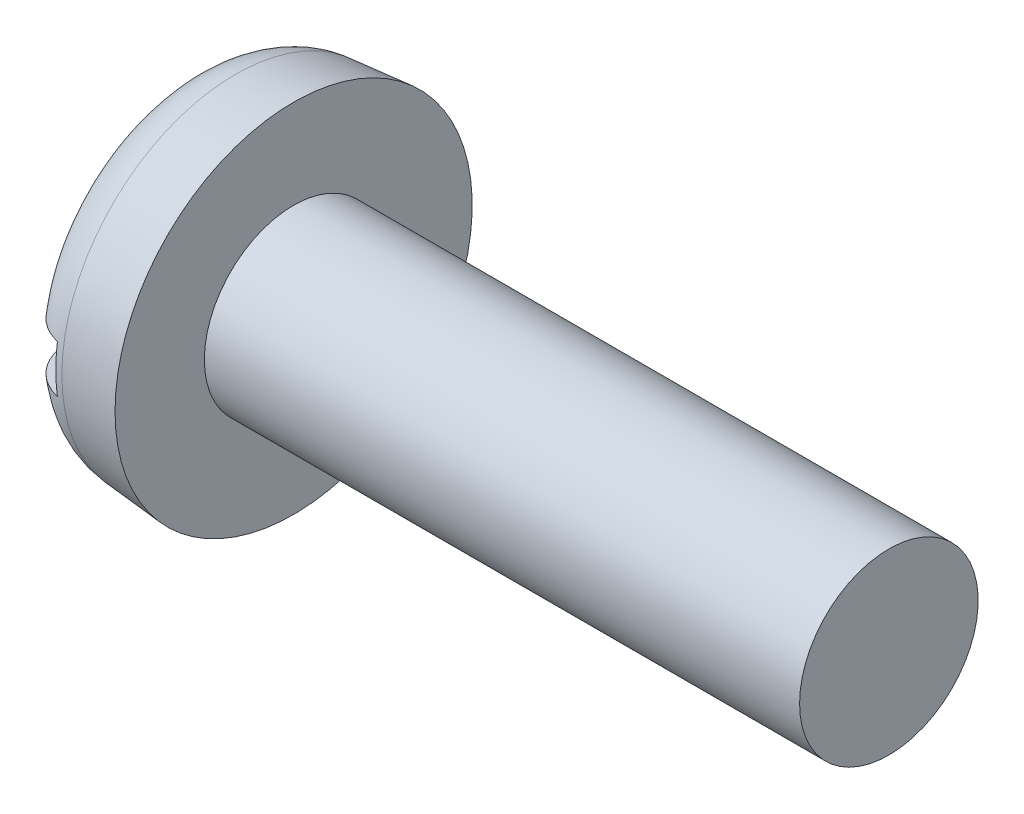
ISO-10303-21;
HEADER;
FILE_DESCRIPTION(('STEP AP214'),'2;1');
FILE_NAME('part.step','',(''),(''),'','','');
FILE_SCHEMA(('AUTOMOTIVE_DESIGN { 1 0 10303 214 1 1 1 1 }'));
ENDSEC;
DATA;
#1=APPLICATION_CONTEXT('core data for automotive mechanical design processes');
#2=APPLICATION_PROTOCOL_DEFINITION('international standard','automotive_design',2000,#1);
#3=PRODUCT_CONTEXT('',#1,'mechanical');
#4=PRODUCT('Part','Part','',(#3));
#5=PRODUCT_RELATED_PRODUCT_CATEGORY('part','',(#4));
#6=PRODUCT_DEFINITION_FORMATION('','',#4);
#7=PRODUCT_DEFINITION_CONTEXT('part definition',#1,'design');
#8=PRODUCT_DEFINITION('design','',#6,#7);
#9=PRODUCT_DEFINITION_SHAPE('','',#8);
#10=(LENGTH_UNIT() NAMED_UNIT(*) SI_UNIT(.MILLI.,.METRE.));
#11=(NAMED_UNIT(*) PLANE_ANGLE_UNIT() SI_UNIT($,.RADIAN.));
#12=(NAMED_UNIT(*) SI_UNIT($,.STERADIAN.) SOLID_ANGLE_UNIT());
#13=UNCERTAINTY_MEASURE_WITH_UNIT(LENGTH_MEASURE(1.E-05),#10,'distance_accuracy_value','');
#14=(GEOMETRIC_REPRESENTATION_CONTEXT(3) GLOBAL_UNCERTAINTY_ASSIGNED_CONTEXT((#13)) GLOBAL_UNIT_ASSIGNED_CONTEXT((#10,
#11,#12)) REPRESENTATION_CONTEXT('',''));
#15=CARTESIAN_POINT('',(0.,0.,0.));
#16=DIRECTION('',(0.,0.,1.));
#17=DIRECTION('',(1.,0.,0.));
#18=AXIS2_PLACEMENT_3D('',#15,#16,#17);
#19=CARTESIAN_POINT('',(0.,0.,0.));
#20=DIRECTION('',(-1.,0.,0.));
#21=DIRECTION('',(0.,0.,1.));
#22=AXIS2_PLACEMENT_3D('',#19,#20,#21);
#23=PLANE('',#22);
#24=DIRECTION('',(0.,0.,-1.));
#25=VECTOR('',#24,1.);
#26=CARTESIAN_POINT('',(0.,0.799999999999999,6.));
#27=LINE('',#26,#25);
#28=CARTESIAN_POINT('',(0.,0.799999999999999,3.9555566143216));
#29=VERTEX_POINT('',#28);
#30=CARTESIAN_POINT('',(0.,0.799999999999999,-3.9555566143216));
#31=VERTEX_POINT('',#30);
#32=EDGE_CURVE('E85',#29,#31,#27,.T.);
#33=ORIENTED_EDGE('',*,*,#32,.F.);
#34=CARTESIAN_POINT('',(0.,0.,0.));
#35=DIRECTION('',(-1.,0.,0.));
#36=DIRECTION('',(0.,0.,1.));
#37=AXIS2_PLACEMENT_3D('',#34,#35,#36);
#38=CIRCLE('',#37,4.03564469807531);
#39=EDGE_CURVE('E91',#29,#31,#38,.T.);
#40=ORIENTED_EDGE('',*,*,#39,.T.);
#41=EDGE_LOOP('',(#33,#40));
#42=FACE_BOUND('',#41,.T.);
#43=ADVANCED_FACE('F32',(#42),#23,.T.);
#44=CARTESIAN_POINT('',(-25.4,0.,0.));
#45=DIRECTION('',(-1.,0.,0.));
#46=DIRECTION('',(0.,0.,1.));
#47=AXIS2_PLACEMENT_3D('',#44,#45,#46);
#48=CYLINDRICAL_SURFACE('',#47,3.);
#49=CARTESIAN_POINT('',(23.6,0.,0.));
#50=DIRECTION('',(-1.,0.,0.));
#51=DIRECTION('',(0.,0.,1.));
#52=AXIS2_PLACEMENT_3D('',#49,#50,#51);
#53=CIRCLE('',#52,3.);
#54=CARTESIAN_POINT('',(23.6,0.,3.));
#55=VERTEX_POINT('',#54);
#56=EDGE_CURVE('E92',#55,#55,#53,.T.);
#57=ORIENTED_EDGE('',*,*,#56,.T.);
#58=EDGE_LOOP('',(#57));
#59=FACE_BOUND('',#58,.T.);
#60=CARTESIAN_POINT('',(3.6,0.,0.));
#61=DIRECTION('',(-1.,0.,0.));
#62=DIRECTION('',(0.,0.,1.));
#63=AXIS2_PLACEMENT_3D('',#60,#61,#62);
#64=CIRCLE('',#63,3.);
#65=CARTESIAN_POINT('',(3.6,0.,3.));
#66=VERTEX_POINT('',#65);
#67=EDGE_CURVE('E149',#66,#66,#64,.T.);
#68=ORIENTED_EDGE('',*,*,#67,.F.);
#69=EDGE_LOOP('',(#68));
#70=FACE_BOUND('',#69,.T.);
#71=ADVANCED_FACE('F137',(#59,#70),#48,.T.);
#72=CARTESIAN_POINT('',(23.6,3.,0.));
#73=DIRECTION('',(1.,0.,0.));
#74=DIRECTION('',(0.,0.,-1.));
#75=AXIS2_PLACEMENT_3D('',#72,#73,#74);
#76=PLANE('',#75);
#77=ORIENTED_EDGE('',*,*,#56,.F.);
#78=EDGE_LOOP('',(#77));
#79=FACE_BOUND('',#78,.T.);
#80=ADVANCED_FACE('F135',(#79),#76,.T.);
#81=DIRECTION('',(0.,0.,1.));
#82=VECTOR('',#81,1.);
#83=CARTESIAN_POINT('',(0.,-0.799999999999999,-6.));
#84=LINE('',#83,#82);
#85=CARTESIAN_POINT('',(0.,-0.799999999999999,-3.9555566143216));
#86=VERTEX_POINT('',#85);
#87=CARTESIAN_POINT('',(0.,-0.800000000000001,3.9555566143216));
#88=VERTEX_POINT('',#87);
#89=EDGE_CURVE('E76',#86,#88,#84,.T.);
#90=ORIENTED_EDGE('',*,*,#89,.F.);
#91=EDGE_CURVE('E83',#86,#88,#38,.T.);
#92=ORIENTED_EDGE('',*,*,#91,.T.);
#93=EDGE_LOOP('',(#90,#92));
#94=FACE_BOUND('',#93,.T.);
#95=ADVANCED_FACE('F82',(#94),#23,.T.);
#96=CARTESIAN_POINT('',(0.,0.,0.));
#97=DIRECTION('',(1.,0.,0.));
#98=DIRECTION('',(0.,0.,-1.));
#99=AXIS2_PLACEMENT_3D('',#96,#97,#98);
#100=CONICAL_SURFACE('',#99,5.68504081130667,0.0872664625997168);
#101=CARTESIAN_POINT('',(1.64311966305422,0.,0.));
#102=DIRECTION('',(-1.,0.,0.));
#103=DIRECTION('',(0.,0.,1.));
#104=AXIS2_PLACEMENT_3D('',#101,#102,#103);
#105=CIRCLE('',#104,5.82879515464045);
#106=CARTESIAN_POINT('',(1.64311966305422,0.,5.82879515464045));
#107=VERTEX_POINT('',#106);
#108=EDGE_CURVE('E95',#107,#107,#105,.F.);
#109=ORIENTED_EDGE('',*,*,#108,.T.);
#110=EDGE_LOOP('',(#109));
#111=FACE_BOUND('',#110,.T.);
#112=CARTESIAN_POINT('',(3.6,0.,0.));
#113=DIRECTION('',(-1.,0.,0.));
#114=DIRECTION('',(0.,0.,1.));
#115=AXIS2_PLACEMENT_3D('',#112,#113,#114);
#116=CIRCLE('',#115,6.);
#117=CARTESIAN_POINT('',(3.6,0.,6.));
#118=VERTEX_POINT('',#117);
#119=EDGE_CURVE('E97',#118,#118,#116,.T.);
#120=ORIENTED_EDGE('',*,*,#119,.T.);
#121=EDGE_LOOP('',(#120));
#122=FACE_BOUND('',#121,.T.);
#123=ADVANCED_FACE('F128',(#111,#122),#100,.T.);
#124=CARTESIAN_POINT('',(3.6,3.,0.));
#125=DIRECTION('',(-1.,0.,0.));
#126=DIRECTION('',(0.,0.,1.));
#127=AXIS2_PLACEMENT_3D('',#124,#125,#126);
#128=PLANE('',#127);
#129=ORIENTED_EDGE('',*,*,#119,.F.);
#130=EDGE_LOOP('',(#129));
#131=FACE_BOUND('',#130,.T.);
#132=ORIENTED_EDGE('',*,*,#67,.T.);
#133=EDGE_LOOP('',(#132));
#134=FACE_BOUND('',#133,.T.);
#135=ADVANCED_FACE('F124',(#131,#134),#128,.F.);
#136=CARTESIAN_POINT('',(1.8,0.,0.));
#137=DIRECTION('',(-1.,0.,0.));
#138=DIRECTION('',(0.,0.,1.));
#139=AXIS2_PLACEMENT_3D('',#136,#137,#138);
#140=TOROIDAL_SURFACE('',#139,4.03564469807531,1.8);
#141=CARTESIAN_POINT('',(0.540762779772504,0.799999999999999,-5.2613759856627));
#142=CARTESIAN_POINT('',(0.612348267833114,0.799999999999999,-5.33226007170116));
#143=CARTESIAN_POINT('',(0.689931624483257,0.799999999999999,-5.3971854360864));
#144=CARTESIAN_POINT('',(0.854947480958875,0.799999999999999,-5.51316161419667));
#145=CARTESIAN_POINT('',(0.94239068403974,0.799999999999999,-5.56419714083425));
#146=CARTESIAN_POINT('',(1.12461220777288,0.799999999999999,-5.650821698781));
#147=CARTESIAN_POINT('',(1.21938917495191,0.799999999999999,-5.6864135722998));
#148=CARTESIAN_POINT('',(1.41356630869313,0.799999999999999,-5.74109194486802));
#149=CARTESIAN_POINT('',(1.51296538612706,0.799999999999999,-5.76018231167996));
#150=CARTESIAN_POINT('',(1.71313899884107,0.799999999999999,-5.78126121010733));
#151=CARTESIAN_POINT('',(1.81390602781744,0.799999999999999,-5.78332104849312));
#152=CARTESIAN_POINT('',(2.01435310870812,0.799999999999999,-5.77046455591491));
#153=CARTESIAN_POINT('',(2.11403314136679,0.799999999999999,-5.75554792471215));
#154=CARTESIAN_POINT('',(2.309314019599,0.799999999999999,-5.70921606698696));
#155=CARTESIAN_POINT('',(2.40492104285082,0.799999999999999,-5.67782686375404));
#156=CARTESIAN_POINT('',(2.58952927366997,0.799999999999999,-5.59948776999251));
#157=CARTESIAN_POINT('',(2.67853045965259,0.799999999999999,-5.55253782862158));
#158=CARTESIAN_POINT('',(2.84769451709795,0.799999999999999,-5.44428887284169));
#159=CARTESIAN_POINT('',(2.92783091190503,0.799999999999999,-5.38294849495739));
#160=CARTESIAN_POINT('',(3.07676159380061,0.799999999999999,-5.24777626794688));
#161=CARTESIAN_POINT('',(3.1455556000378,0.799999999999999,-5.17394410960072));
#162=CARTESIAN_POINT('',(3.27042510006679,0.799999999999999,-5.01531035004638));
#163=CARTESIAN_POINT('',(3.32640120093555,0.799999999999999,-4.93043053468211));
#164=CARTESIAN_POINT('',(3.4235057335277,0.799999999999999,-4.75256933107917));
#165=CARTESIAN_POINT('',(3.46463341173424,0.799999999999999,-4.65958753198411));
#166=CARTESIAN_POINT('',(3.53144158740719,0.799999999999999,-4.46694835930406));
#167=CARTESIAN_POINT('',(3.55692557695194,0.799999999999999,-4.36722286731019));
#168=CARTESIAN_POINT('',(3.59108701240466,0.799999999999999,-4.16493761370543));
#169=CARTESIAN_POINT('',(3.59976314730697,0.799999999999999,-4.06237763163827));
#170=CARTESIAN_POINT('',(3.60023112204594,0.799999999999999,-3.85550711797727));
#171=CARTESIAN_POINT('',(3.59173848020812,0.799999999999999,-3.75119596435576));
#172=CARTESIAN_POINT('',(3.55768438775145,0.799999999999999,-3.54539907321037));
#173=CARTESIAN_POINT('',(3.53212117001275,0.799999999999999,-3.44391362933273));
#174=CARTESIAN_POINT('',(3.46412322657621,0.799999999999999,-3.24471369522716));
#175=CARTESIAN_POINT('',(3.42139292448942,0.799999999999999,-3.14710004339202));
#176=CARTESIAN_POINT('',(3.32030286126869,0.799999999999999,-2.96031799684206));
#177=CARTESIAN_POINT('',(3.26194098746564,0.799999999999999,-2.87115074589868));
#178=CARTESIAN_POINT('',(3.13053846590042,0.799999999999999,-2.70303664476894));
#179=CARTESIAN_POINT('',(3.05736818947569,0.799999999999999,-2.62419095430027));
#180=CARTESIAN_POINT('',(2.89859048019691,0.799999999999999,-2.48017518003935));
#181=CARTESIAN_POINT('',(2.81298317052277,0.799999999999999,-2.41500496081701));
#182=CARTESIAN_POINT('',(2.6334271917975,0.799999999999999,-2.30187272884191));
#183=CARTESIAN_POINT('',(2.53967929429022,0.799999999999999,-2.25359299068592));
#184=CARTESIAN_POINT('',(2.34507363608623,0.799999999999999,-2.17455467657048));
#185=CARTESIAN_POINT('',(2.24421969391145,0.799999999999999,-2.14378676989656));
#186=CARTESIAN_POINT('',(2.04443930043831,0.799999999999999,-2.10254396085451));
#187=CARTESIAN_POINT('',(1.94573097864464,0.799999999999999,-2.09101175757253));
#188=CARTESIAN_POINT('',(1.74783816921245,0.799999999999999,-2.08550669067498));
#189=CARTESIAN_POINT('',(1.64865381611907,0.799999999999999,-2.09152912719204));
#190=CARTESIAN_POINT('',(1.45702700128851,0.799999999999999,-2.12018138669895));
#191=CARTESIAN_POINT('',(1.36447664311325,0.799999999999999,-2.14209986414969));
#192=CARTESIAN_POINT('',(1.18420660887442,0.799999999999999,-2.20075771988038));
#193=CARTESIAN_POINT('',(1.09648771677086,0.799999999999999,-2.23749949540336));
#194=CARTESIAN_POINT('',(0.925723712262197,0.799999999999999,-2.32557805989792));
#195=CARTESIAN_POINT('',(0.842868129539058,0.799999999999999,-2.37728131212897));
#196=CARTESIAN_POINT('',(0.686362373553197,0.799999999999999,-2.493116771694));
#197=CARTESIAN_POINT('',(0.612714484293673,0.799999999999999,-2.55725205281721));
#198=CARTESIAN_POINT('',(0.472161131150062,0.799999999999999,-2.70027682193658));
#199=CARTESIAN_POINT('',(0.405916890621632,0.799999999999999,-2.77981681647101));
#200=CARTESIAN_POINT('',(0.287173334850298,0.799999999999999,-2.9485732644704));
#201=CARTESIAN_POINT('',(0.234676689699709,0.799999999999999,-3.03779159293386));
#202=CARTESIAN_POINT('',(0.143214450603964,0.799999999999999,-3.22677844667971));
#203=CARTESIAN_POINT('',(0.104782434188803,0.799999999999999,-3.32680584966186));
#204=CARTESIAN_POINT('',(0.0452446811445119,0.799999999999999,-3.5318922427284));
#205=CARTESIAN_POINT('',(0.0241387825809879,0.799999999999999,-3.63695118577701));
#206=CARTESIAN_POINT('',(-1.12670491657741E-05,0.799999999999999,-3.84916824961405));
#207=CARTESIAN_POINT('',(-0.00304965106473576,0.799999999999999,-3.95632702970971));
#208=CARTESIAN_POINT('',(0.00921984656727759,0.799999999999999,-4.16962319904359));
#209=CARTESIAN_POINT('',(0.0245310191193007,0.799999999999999,-4.27576040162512));
#210=CARTESIAN_POINT('',(0.0728327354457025,0.799999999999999,-4.48216521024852));
#211=CARTESIAN_POINT('',(0.105541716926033,0.799999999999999,-4.58249883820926));
#212=CARTESIAN_POINT('',(0.187634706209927,0.799999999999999,-4.77599767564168));
#213=CARTESIAN_POINT('',(0.236996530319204,0.799999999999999,-4.86917222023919));
#214=CARTESIAN_POINT('',(0.329466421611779,0.799999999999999,-5.01228034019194));
#215=CARTESIAN_POINT('',(0.367921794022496,0.799999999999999,-5.06527765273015));
#216=CARTESIAN_POINT('',(0.450329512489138,0.799999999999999,-5.16681267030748));
#217=CARTESIAN_POINT('',(0.494281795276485,0.799999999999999,-5.21535042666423));
#218=CARTESIAN_POINT('',(0.540762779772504,0.799999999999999,-5.2613759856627));
#219=B_SPLINE_CURVE_WITH_KNOTS('',3,(#141,#142,#143,#144,#145,#146,#147,#148,#149,#150,#151,
#152,#153,#154,#155,#156,#157,#158,#159,#160,#161,#162,#163,#164,#165,#166,#167,#168,#169,#170,
#171,#172,#173,#174,#175,#176,#177,#178,#179,#180,#181,#182,#183,#184,#185,#186,#187,#188,#189,
#190,#191,#192,#193,#194,#195,#196,#197,#198,#199,#200,#201,#202,#203,#204,#205,#206,#207,#208,
#209,#210,#211,#212,#213,#214,#215,#216,#217,#218),.UNSPECIFIED.,.T.,.F.,(4,2,2,2,2,2,2,2,2,2,2,
2,2,2,2,2,2,2,2,2,2,2,2,2,2,2,2,2,2,2,2,2,2,2,2,2,2,2,4),(0.,0.301990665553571,
0.604312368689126,0.906578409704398,1.20877358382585,1.50970282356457,1.81063738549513,
2.11109795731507,2.41155951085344,2.71289551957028,3.01423898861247,3.31784547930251,
3.6214673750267,3.92882908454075,4.23621476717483,4.54873547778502,4.86128854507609,
5.17947093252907,5.49769634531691,5.81883829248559,6.13997705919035,6.45470120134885,
6.76925749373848,7.06587349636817,7.36241009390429,7.64643650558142,7.93050886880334,
8.22223277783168,8.51402890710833,8.8231740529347,9.13237919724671,9.45232886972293,
9.77227555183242,10.0923243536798,10.4124305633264,10.7275071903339,11.042165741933,
11.2382527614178,11.4343375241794),.UNSPECIFIED.);
#220=CARTESIAN_POINT('',(1.4,0.799999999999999,-5.73510972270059));
#221=VERTEX_POINT('',#220);
#222=EDGE_CURVE('E11',#31,#221,#219,.T.);
#223=ORIENTED_EDGE('',*,*,#222,.F.);
#224=ORIENTED_EDGE('',*,*,#39,.F.);
#225=CARTESIAN_POINT('',(0.836266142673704,0.799999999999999,2.3847675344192));
#226=CARTESIAN_POINT('',(0.917616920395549,0.799999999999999,2.33037611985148));
#227=CARTESIAN_POINT('',(1.00338812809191,0.799999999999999,2.28250940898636));
#228=CARTESIAN_POINT('',(1.18171371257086,0.799999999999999,2.20157945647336));
#229=CARTESIAN_POINT('',(1.27427138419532,0.799999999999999,2.16852346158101));
#230=CARTESIAN_POINT('',(1.46387360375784,0.799999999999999,2.11861651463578));
#231=CARTESIAN_POINT('',(1.56092620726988,0.799999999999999,2.10179593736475));
#232=CARTESIAN_POINT('',(1.75645828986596,0.799999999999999,2.08531619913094));
#233=CARTESIAN_POINT('',(1.85493729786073,0.799999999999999,2.08565149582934));
#234=CARTESIAN_POINT('',(2.04724581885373,0.799999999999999,2.10316628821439));
#235=CARTESIAN_POINT('',(2.1411242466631,0.799999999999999,2.11981673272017));
#236=CARTESIAN_POINT('',(2.32483197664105,0.799999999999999,2.16840533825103));
#237=CARTESIAN_POINT('',(2.41466058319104,0.799999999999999,2.20034611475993));
#238=CARTESIAN_POINT('',(2.58937479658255,0.799999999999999,2.27883470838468));
#239=CARTESIAN_POINT('',(2.67416016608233,0.799999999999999,2.32560484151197));
#240=CARTESIAN_POINT('',(2.83527159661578,0.799999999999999,2.43194790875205));
#241=CARTESIAN_POINT('',(2.91159566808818,0.799999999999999,2.4915238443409));
#242=CARTESIAN_POINT('',(3.05833847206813,0.799999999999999,2.62557742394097));
#243=CARTESIAN_POINT('',(3.12814463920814,0.799999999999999,2.70072607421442));
#244=CARTESIAN_POINT('',(3.25476371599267,0.799999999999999,2.86127427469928));
#245=CARTESIAN_POINT('',(3.31157384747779,0.799999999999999,2.94667601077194));
#246=CARTESIAN_POINT('',(3.41282909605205,0.799999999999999,3.12914373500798));
#247=CARTESIAN_POINT('',(3.4566732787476,0.799999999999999,3.22654397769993));
#248=CARTESIAN_POINT('',(3.52749042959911,0.799999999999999,3.42730182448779));
#249=CARTESIAN_POINT('',(3.55446245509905,0.799999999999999,3.53065976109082));
#250=CARTESIAN_POINT('',(3.59074777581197,0.799999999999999,3.74099682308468));
#251=CARTESIAN_POINT('',(3.59996828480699,0.799999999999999,3.84799201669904));
#252=CARTESIAN_POINT('',(3.60003154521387,0.799999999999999,4.06199242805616));
#253=CARTESIAN_POINT('',(3.59087543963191,0.799999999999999,4.16899764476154));
#254=CARTESIAN_POINT('',(3.5545508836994,0.799999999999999,4.37828946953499));
#255=CARTESIAN_POINT('',(3.5276490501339,0.799999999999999,4.48062230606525));
#256=CARTESIAN_POINT('',(3.45672417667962,0.799999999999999,4.67917518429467));
#257=CARTESIAN_POINT('',(3.41270279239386,0.799999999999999,4.77539581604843));
#258=CARTESIAN_POINT('',(3.30967441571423,0.799999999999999,4.95711293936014));
#259=CARTESIAN_POINT('',(3.2509575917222,0.799999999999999,5.04277397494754));
#260=CARTESIAN_POINT('',(3.11977209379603,0.799999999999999,5.20282644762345));
#261=CARTESIAN_POINT('',(3.04730458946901,0.799999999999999,5.27721884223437));
#262=CARTESIAN_POINT('',(2.89186263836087,0.799999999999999,5.41145672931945));
#263=CARTESIAN_POINT('',(2.80906226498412,0.799999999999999,5.47150384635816));
#264=CARTESIAN_POINT('',(2.63447307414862,0.799999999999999,5.57667826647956));
#265=CARTESIAN_POINT('',(2.54268479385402,0.799999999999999,5.62180646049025));
#266=CARTESIAN_POINT('',(2.35372245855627,0.799999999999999,5.69541178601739));
#267=CARTESIAN_POINT('',(2.25661170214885,0.799999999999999,5.72405148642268));
#268=CARTESIAN_POINT('',(2.05894963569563,0.799999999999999,5.76452632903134));
#269=CARTESIAN_POINT('',(1.95839844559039,0.799999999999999,5.77636205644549));
#270=CARTESIAN_POINT('',(1.75726466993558,0.799999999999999,5.78286013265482));
#271=CARTESIAN_POINT('',(1.65668492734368,0.799999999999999,5.77761084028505));
#272=CARTESIAN_POINT('',(1.45783846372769,0.799999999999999,5.75028865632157));
#273=CARTESIAN_POINT('',(1.35957171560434,0.799999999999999,5.72821596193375));
#274=CARTESIAN_POINT('',(1.16819371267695,0.799999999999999,5.66791633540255));
#275=CARTESIAN_POINT('',(1.07507939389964,0.799999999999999,5.62969912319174));
#276=CARTESIAN_POINT('',(0.896555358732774,0.799999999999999,5.53823241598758));
#277=CARTESIAN_POINT('',(0.811145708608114,0.799999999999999,5.4849827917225));
#278=CARTESIAN_POINT('',(0.650082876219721,0.799999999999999,5.36476593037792));
#279=CARTESIAN_POINT('',(0.574468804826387,0.799999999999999,5.29774630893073));
#280=CARTESIAN_POINT('',(0.435451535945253,0.799999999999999,5.15205983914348));
#281=CARTESIAN_POINT('',(0.372048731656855,0.799999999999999,5.07339261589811));
#282=CARTESIAN_POINT('',(0.258650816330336,0.799999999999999,4.90594446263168));
#283=CARTESIAN_POINT('',(0.208774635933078,0.799999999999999,4.81708301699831));
#284=CARTESIAN_POINT('',(0.124428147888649,0.799999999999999,4.63233098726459));
#285=CARTESIAN_POINT('',(0.0899587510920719,0.799999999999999,4.53643998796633));
#286=CARTESIAN_POINT('',(0.0368868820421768,0.799999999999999,4.33899079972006));
#287=CARTESIAN_POINT('',(0.0185025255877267,0.799999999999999,4.23737401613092));
#288=CARTESIAN_POINT('',(-0.00125734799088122,0.799999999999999,4.03250747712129));
#289=CARTESIAN_POINT('',(-0.00263209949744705,0.799999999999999,3.9292576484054));
#290=CARTESIAN_POINT('',(0.0116307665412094,0.799999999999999,3.72214563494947));
#291=CARTESIAN_POINT('',(0.0275632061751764,0.799999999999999,3.61830377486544));
#292=CARTESIAN_POINT('',(0.0763335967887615,0.799999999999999,3.41464106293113));
#293=CARTESIAN_POINT('',(0.10917724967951,0.799999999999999,3.31482157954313));
#294=CARTESIAN_POINT('',(0.191511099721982,0.799999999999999,3.12021092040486));
#295=CARTESIAN_POINT('',(0.241286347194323,0.799999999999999,3.02554040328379));
#296=CARTESIAN_POINT('',(0.355915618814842,0.799999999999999,2.8458978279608));
#297=CARTESIAN_POINT('',(0.420755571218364,0.799999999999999,2.76091682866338));
#298=CARTESIAN_POINT('',(0.543269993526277,0.799999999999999,2.62572980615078));
#299=CARTESIAN_POINT('',(0.597683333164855,0.799999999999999,2.57253239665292));
#300=CARTESIAN_POINT('',(0.712598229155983,0.799999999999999,2.4731680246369));
#301=CARTESIAN_POINT('',(0.773099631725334,0.799999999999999,2.42700088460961));
#302=CARTESIAN_POINT('',(0.836266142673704,0.799999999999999,2.3847675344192));
#303=B_SPLINE_CURVE_WITH_KNOTS('',3,(#225,#226,#227,#228,#229,#230,#231,#232,#233,#234,#235,
#236,#237,#238,#239,#240,#241,#242,#243,#244,#245,#246,#247,#248,#249,#250,#251,#252,#253,#254,
#255,#256,#257,#258,#259,#260,#261,#262,#263,#264,#265,#266,#267,#268,#269,#270,#271,#272,#273,
#274,#275,#276,#277,#278,#279,#280,#281,#282,#283,#284,#285,#286,#287,#288,#289,#290,#291,#292,
#293,#294,#295,#296,#297,#298,#299,#300,#301,#302),.UNSPECIFIED.,.T.,.F.,(4,2,2,2,2,2,2,2,2,2,2,
2,2,2,2,2,2,2,2,2,2,2,2,2,2,2,2,2,2,2,2,2,2,2,2,2,2,2,4),(0.,0.293321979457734,
0.586787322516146,0.880800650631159,1.17471899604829,1.45941156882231,1.74415285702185,
2.03338255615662,2.32268012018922,2.62901646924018,2.93541824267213,3.25435495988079,
3.57330949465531,3.89392670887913,4.21452398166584,4.53041098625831,4.84626744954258,
5.1563211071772,5.46634840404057,5.77172128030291,6.0770759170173,6.37936593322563,
6.6816454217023,6.98236409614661,7.2830792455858,7.5836136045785,7.88415054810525,
8.18585270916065,8.48756458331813,8.79184901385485,9.09615143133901,9.40451898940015,
9.71290042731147,10.0266186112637,10.3404426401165,10.6598354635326,10.9789311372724,
11.2066928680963,11.43444884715),.UNSPECIFIED.);
#304=CARTESIAN_POINT('',(1.4,0.799999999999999,5.73510972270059));
#305=VERTEX_POINT('',#304);
#306=EDGE_CURVE('E109',#305,#29,#303,.T.);
#307=ORIENTED_EDGE('',*,*,#306,.F.);
#308=CARTESIAN_POINT('',(1.4,0.,0.));
#309=DIRECTION('',(-1.,0.,0.));
#310=DIRECTION('',(0.,0.,1.));
#311=AXIS2_PLACEMENT_3D('',#308,#309,#310);
#312=CIRCLE('',#311,5.79063757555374);
#313=CARTESIAN_POINT('',(1.4,-0.800000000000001,5.73510972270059));
#314=VERTEX_POINT('',#313);
#315=EDGE_CURVE('E103',#305,#314,#312,.F.);
#316=ORIENTED_EDGE('',*,*,#315,.T.);
#317=CARTESIAN_POINT('',(0.836266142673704,-0.8,2.3847675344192));
#318=CARTESIAN_POINT('',(0.748506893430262,-0.8,2.44345191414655));
#319=CARTESIAN_POINT('',(0.665766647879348,-0.8,2.50981960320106));
#320=CARTESIAN_POINT('',(0.512551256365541,-0.8,2.65561376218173));
#321=CARTESIAN_POINT('',(0.442099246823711,-0.8,2.73506432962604));
#322=CARTESIAN_POINT('',(0.315475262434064,-0.8,2.90443495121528));
#323=CARTESIAN_POINT('',(0.259280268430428,-0.8,2.99433778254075));
#324=CARTESIAN_POINT('',(0.162548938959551,-0.8,3.18215299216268));
#325=CARTESIAN_POINT('',(0.122006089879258,-0.8,3.28006201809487));
#326=CARTESIAN_POINT('',(0.0572425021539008,-0.8,3.4827212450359));
#327=CARTESIAN_POINT('',(0.0332676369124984,-0.8,3.58755021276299));
#328=CARTESIAN_POINT('',(0.00342578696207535,-0.8,3.79976969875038));
#329=CARTESIAN_POINT('',(-0.00244009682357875,-0.800000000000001,3.90716037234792));
#330=CARTESIAN_POINT('',(0.00425089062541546,-0.800000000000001,4.12040369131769));
#331=CARTESIAN_POINT('',(0.0166422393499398,-0.800000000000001,4.22626147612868));
#332=CARTESIAN_POINT('',(0.0593599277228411,-0.800000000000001,4.43429705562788));
#333=CARTESIAN_POINT('',(0.0896844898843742,-0.800000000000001,4.53647521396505));
#334=CARTESIAN_POINT('',(0.166811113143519,-0.800000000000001,4.73226366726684));
#335=CARTESIAN_POINT('',(0.21330327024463,-0.800000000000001,4.82599604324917));
#336=CARTESIAN_POINT('',(0.32162267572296,-0.800000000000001,5.00413844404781));
#337=CARTESIAN_POINT('',(0.383448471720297,-0.800000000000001,5.08854935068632));
#338=CARTESIAN_POINT('',(0.519544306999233,-0.800000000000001,5.24416143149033));
#339=CARTESIAN_POINT('',(0.593588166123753,-0.800000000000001,5.31556046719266));
#340=CARTESIAN_POINT('',(0.752739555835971,-0.800000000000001,5.44472836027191));
#341=CARTESIAN_POINT('',(0.837846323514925,-0.800000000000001,5.5024981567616));
#342=CARTESIAN_POINT('',(1.01558854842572,-0.800000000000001,5.60205300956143));
#343=CARTESIAN_POINT('',(1.10812041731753,-0.800000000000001,5.64402306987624));
#344=CARTESIAN_POINT('',(1.29895009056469,-0.800000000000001,5.71170590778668));
#345=CARTESIAN_POINT('',(1.39724763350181,-0.800000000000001,5.7374194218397));
#346=CARTESIAN_POINT('',(1.59606633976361,-0.800000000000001,5.77169733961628));
#347=CARTESIAN_POINT('',(1.69656671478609,-0.800000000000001,5.78038241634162));
#348=CARTESIAN_POINT('',(1.89759433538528,-0.800000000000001,5.78071120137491));
#349=CARTESIAN_POINT('',(1.99812158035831,-0.800000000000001,5.77235526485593));
#350=CARTESIAN_POINT('',(2.19609344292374,-0.800000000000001,5.73889133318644));
#351=CARTESIAN_POINT('',(2.29354498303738,-0.800000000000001,5.71382425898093));
#352=CARTESIAN_POINT('',(2.48286854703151,-0.800000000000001,5.64771711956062));
#353=CARTESIAN_POINT('',(2.57474056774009,-0.800000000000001,5.60667704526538));
#354=CARTESIAN_POINT('',(2.75051258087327,-0.800000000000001,5.50972539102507));
#355=CARTESIAN_POINT('',(2.8343959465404,-0.800000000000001,5.45378367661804));
#356=CARTESIAN_POINT('',(2.99165678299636,-0.800000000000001,5.32869697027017));
#357=CARTESIAN_POINT('',(3.06503402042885,-0.800000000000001,5.25955168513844));
#358=CARTESIAN_POINT('',(3.19973989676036,-0.800000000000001,5.10955333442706));
#359=CARTESIAN_POINT('',(3.26098586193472,-0.800000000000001,5.02862604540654));
#360=CARTESIAN_POINT('',(3.36919753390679,-0.800000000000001,4.85773374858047));
#361=CARTESIAN_POINT('',(3.41616259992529,-0.800000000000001,4.76776833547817));
#362=CARTESIAN_POINT('',(3.49507738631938,-0.800000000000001,4.5802716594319));
#363=CARTESIAN_POINT('',(3.52685014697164,-0.800000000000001,4.48266594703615));
#364=CARTESIAN_POINT('',(3.57383908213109,-0.800000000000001,4.28355151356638));
#365=CARTESIAN_POINT('',(3.58905405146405,-0.800000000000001,4.18204250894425));
#366=CARTESIAN_POINT('',(3.60277332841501,-0.800000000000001,3.97627512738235));
#367=CARTESIAN_POINT('',(3.60100695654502,-0.8,3.87199872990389));
#368=CARTESIAN_POINT('',(3.58032198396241,-0.8,3.66516328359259));
#369=CARTESIAN_POINT('',(3.56140169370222,-0.8,3.56260440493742));
#370=CARTESIAN_POINT('',(3.50655445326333,-0.8,3.3601262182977));
#371=CARTESIAN_POINT('',(3.47032341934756,-0.8,3.26028924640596));
#372=CARTESIAN_POINT('',(3.38182060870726,-0.8,3.06798854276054));
#373=CARTESIAN_POINT('',(3.32954675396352,-0.8,2.97552576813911));
#374=CARTESIAN_POINT('',(3.20964725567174,-0.8,2.79948120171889));
#375=CARTESIAN_POINT('',(3.14184223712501,-0.8,2.71602141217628));
#376=CARTESIAN_POINT('',(2.99302219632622,-0.8,2.56181483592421));
#377=CARTESIAN_POINT('',(2.91200632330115,-0.8,2.49106886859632));
#378=CARTESIAN_POINT('',(2.73997760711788,-0.8,2.36551639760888));
#379=CARTESIAN_POINT('',(2.64910309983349,-0.8,2.31052086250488));
#380=CARTESIAN_POINT('',(2.4590409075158,-0.8,2.21753014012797));
#381=CARTESIAN_POINT('',(2.35985743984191,-0.8,2.17952638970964));
#382=CARTESIAN_POINT('',(2.16147923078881,-0.8,2.12383562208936));
#383=CARTESIAN_POINT('',(2.06255196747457,-0.8,2.10519696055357));
#384=CARTESIAN_POINT('',(1.86294330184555,-0.8,2.08580594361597));
#385=CARTESIAN_POINT('',(1.76226208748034,-0.8,2.08505168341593));
#386=CARTESIAN_POINT('',(1.56749167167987,-0.8,2.1010369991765));
#387=CARTESIAN_POINT('',(1.47332742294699,-0.8,2.11688981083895));
#388=CARTESIAN_POINT('',(1.28901868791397,-0.8,2.16397488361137));
#389=CARTESIAN_POINT('',(1.19886974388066,-0.8,2.19518960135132));
#390=CARTESIAN_POINT('',(1.0638315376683,-0.8,2.25452352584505));
#391=CARTESIAN_POINT('',(1.01673933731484,-0.8,2.27777851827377));
#392=CARTESIAN_POINT('',(0.924773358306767,-0.8,2.32831196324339));
#393=CARTESIAN_POINT('',(0.879899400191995,-0.8,2.35559008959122));
#394=CARTESIAN_POINT('',(0.836266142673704,-0.8,2.3847675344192));
#395=B_SPLINE_CURVE_WITH_KNOTS('',3,(#317,#318,#319,#320,#321,#322,#323,#324,#325,#326,#327,
#328,#329,#330,#331,#332,#333,#334,#335,#336,#337,#338,#339,#340,#341,#342,#343,#344,#345,#346,
#347,#348,#349,#350,#351,#352,#353,#354,#355,#356,#357,#358,#359,#360,#361,#362,#363,#364,#365,
#366,#367,#368,#369,#370,#371,#372,#373,#374,#375,#376,#377,#378,#379,#380,#381,#382,#383,#384,
#385,#386,#387,#388,#389,#390,#391,#392,#393,#394),.UNSPECIFIED.,.T.,.F.,(4,2,2,2,2,2,2,2,2,2,2,
2,2,2,2,2,2,2,2,2,2,2,2,2,2,2,2,2,2,2,2,2,2,2,2,2,2,2,4),(0.,0.316518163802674,
0.633625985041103,0.950218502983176,1.2666791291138,1.58774070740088,1.90882180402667,
2.22700979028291,2.54516624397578,2.8575328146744,3.16986980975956,3.47696670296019,
3.78404242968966,4.08740155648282,4.39074693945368,4.69193476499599,4.99311631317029,
5.29356304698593,5.59400995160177,5.89506910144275,6.19613493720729,6.49918680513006,
6.80225226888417,7.10876667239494,7.41530338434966,7.72673423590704,8.03819576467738,
8.35534173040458,8.6725287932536,8.99358246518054,9.31465682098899,9.63169865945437,
9.94858054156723,10.2490245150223,10.549436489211,10.8345871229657,11.1194128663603,
11.276796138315,11.4341666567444),.UNSPECIFIED.);
#396=EDGE_CURVE('E90',#88,#314,#395,.T.);
#397=ORIENTED_EDGE('',*,*,#396,.F.);
#398=ORIENTED_EDGE('',*,*,#91,.F.);
#399=CARTESIAN_POINT('',(0.540762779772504,-0.799999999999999,-5.2613759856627));
#400=CARTESIAN_POINT('',(0.46800256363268,-0.799999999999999,-5.18931554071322));
#401=CARTESIAN_POINT('',(0.401331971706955,-0.799999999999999,-5.11098969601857));
#402=CARTESIAN_POINT('',(0.282092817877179,-0.799999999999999,-4.94415021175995));
#403=CARTESIAN_POINT('',(0.229543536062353,-0.799999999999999,-4.85562287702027));
#404=CARTESIAN_POINT('',(0.140058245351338,-0.799999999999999,-4.67111833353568));
#405=CARTESIAN_POINT('',(0.103104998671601,-0.799999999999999,-4.57514948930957));
#406=CARTESIAN_POINT('',(0.0456444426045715,-0.799999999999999,-4.37844736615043));
#407=CARTESIAN_POINT('',(0.0251330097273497,-0.799999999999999,-4.27771528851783));
#408=CARTESIAN_POINT('',(0.000807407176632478,-0.799999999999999,-4.07306902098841));
#409=CARTESIAN_POINT('',(-0.00280970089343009,-0.799999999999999,-3.96913144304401));
#410=CARTESIAN_POINT('',(0.00712688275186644,-0.799999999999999,-3.76207815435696));
#411=CARTESIAN_POINT('',(0.0206829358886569,-0.8,-3.65896255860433));
#412=CARTESIAN_POINT('',(0.0648595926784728,-0.8,-3.45448287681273));
#413=CARTESIAN_POINT('',(0.0957869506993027,-0.8,-3.35318504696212));
#414=CARTESIAN_POINT('',(0.173966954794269,-0.8,-3.15709227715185));
#415=CARTESIAN_POINT('',(0.221221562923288,-0.8,-3.06229812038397));
#416=CARTESIAN_POINT('',(0.331523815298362,-0.8,-2.8805427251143));
#417=CARTESIAN_POINT('',(0.394784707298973,-0.8,-2.79371074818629));
#418=CARTESIAN_POINT('',(0.535080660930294,-0.8,-2.63196239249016));
#419=CARTESIAN_POINT('',(0.612117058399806,-0.8,-2.5570471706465));
#420=CARTESIAN_POINT('',(0.777363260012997,-0.8,-2.42207446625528));
#421=CARTESIAN_POINT('',(0.865488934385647,-0.8,-2.36191424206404));
#422=CARTESIAN_POINT('',(1.05097305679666,-0.8,-2.25807126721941));
#423=CARTESIAN_POINT('',(1.1483280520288,-0.8,-2.21438238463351));
#424=CARTESIAN_POINT('',(1.34472607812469,-0.8,-2.14709500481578));
#425=CARTESIAN_POINT('',(1.44348146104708,-0.8,-2.12265879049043));
#426=CARTESIAN_POINT('',(1.64375523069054,-0.8,-2.09184121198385));
#427=CARTESIAN_POINT('',(1.74527230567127,-0.8,-2.08545142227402));
#428=CARTESIAN_POINT('',(1.94205144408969,-0.8,-2.09089422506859));
#429=CARTESIAN_POINT('',(2.03734311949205,-0.8,-2.1017185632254));
#430=CARTESIAN_POINT('',(2.22475371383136,-0.8,-2.1391955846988));
#431=CARTESIAN_POINT('',(2.31687240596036,-0.8,-2.16584939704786));
#432=CARTESIAN_POINT('',(2.49568716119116,-0.8,-2.23389898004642));
#433=CARTESIAN_POINT('',(2.58237134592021,-0.8,-2.27532580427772));
#434=CARTESIAN_POINT('',(2.74807422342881,-0.8,-2.37138684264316));
#435=CARTESIAN_POINT('',(2.82709115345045,-0.8,-2.42602408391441));
#436=CARTESIAN_POINT('',(2.9799165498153,-0.8,-2.55022645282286));
#437=CARTESIAN_POINT('',(3.05318434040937,-0.8,-2.6204569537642));
#438=CARTESIAN_POINT('',(3.18755425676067,-0.8,-2.77172635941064));
#439=CARTESIAN_POINT('',(3.24865355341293,-0.8,-2.85276777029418));
#440=CARTESIAN_POINT('',(3.35979277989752,-0.8,-3.02754470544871));
#441=CARTESIAN_POINT('',(3.40917690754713,-0.8,-3.1216981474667));
#442=CARTESIAN_POINT('',(3.49164209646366,-0.8,-3.31689856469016));
#443=CARTESIAN_POINT('',(3.52472176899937,-0.8,-3.41794612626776));
#444=CARTESIAN_POINT('',(3.57383047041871,-0.8,-3.62528781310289));
#445=CARTESIAN_POINT('',(3.58966846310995,-0.8,-3.73162733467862));
#446=CARTESIAN_POINT('',(3.60302482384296,-0.8,-3.94545563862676));
#447=CARTESIAN_POINT('',(3.60054405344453,-0.799999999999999,-4.05294436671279));
#448=CARTESIAN_POINT('',(3.57730809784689,-0.799999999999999,-4.26456838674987));
#449=CARTESIAN_POINT('',(3.5567824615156,-0.799999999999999,-4.36872882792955));
#450=CARTESIAN_POINT('',(3.49820144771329,-0.799999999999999,-4.57200098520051));
#451=CARTESIAN_POINT('',(3.46014775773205,-0.799999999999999,-4.67111318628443));
#452=CARTESIAN_POINT('',(3.36835841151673,-0.799999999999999,-4.85952398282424));
#453=CARTESIAN_POINT('',(3.31492535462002,-0.799999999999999,-4.94897001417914));
#454=CARTESIAN_POINT('',(3.19357222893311,-0.799999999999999,-5.1174283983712));
#455=CARTESIAN_POINT('',(3.12565341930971,-0.799999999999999,-5.196441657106));
#456=CARTESIAN_POINT('',(2.97843308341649,-0.799999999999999,-5.34047951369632));
#457=CARTESIAN_POINT('',(2.89932889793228,-0.799999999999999,-5.40570586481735));
#458=CARTESIAN_POINT('',(2.73119091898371,-0.799999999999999,-5.52177624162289));
#459=CARTESIAN_POINT('',(2.64215774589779,-0.799999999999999,-5.57262116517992));
#460=CARTESIAN_POINT('',(2.45774484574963,-0.799999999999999,-5.65792437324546));
#461=CARTESIAN_POINT('',(2.36244515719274,-0.799999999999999,-5.69255575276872));
#462=CARTESIAN_POINT('',(2.16736859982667,-0.799999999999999,-5.7452167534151));
#463=CARTESIAN_POINT('',(2.06759209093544,-0.799999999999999,-5.76324770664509));
#464=CARTESIAN_POINT('',(1.8670464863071,-0.799999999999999,-5.78211504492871));
#465=CARTESIAN_POINT('',(1.76628722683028,-0.799999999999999,-5.78305617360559));
#466=CARTESIAN_POINT('',(1.56601778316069,-0.799999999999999,-5.76798048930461));
#467=CARTESIAN_POINT('',(1.46650790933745,-0.799999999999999,-5.75195954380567));
#468=CARTESIAN_POINT('',(1.27169371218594,-0.799999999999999,-5.70345798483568));
#469=CARTESIAN_POINT('',(1.17638560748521,-0.799999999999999,-5.67099251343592));
#470=CARTESIAN_POINT('',(0.992639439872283,-0.799999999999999,-5.59058259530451));
#471=CARTESIAN_POINT('',(0.904192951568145,-0.799999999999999,-5.54265751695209));
#472=CARTESIAN_POINT('',(0.770167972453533,-0.799999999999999,-5.45480755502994));
#473=CARTESIAN_POINT('',(0.72159797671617,-0.799999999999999,-5.41935523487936));
#474=CARTESIAN_POINT('',(0.628240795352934,-0.799999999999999,-5.34377955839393));
#475=CARTESIAN_POINT('',(0.583453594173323,-0.799999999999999,-5.30365622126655));
#476=CARTESIAN_POINT('',(0.540762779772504,-0.799999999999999,-5.2613759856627));
#477=B_SPLINE_CURVE_WITH_KNOTS('',3,(#399,#400,#401,#402,#403,#404,#405,#406,#407,#408,#409,
#410,#411,#412,#413,#414,#415,#416,#417,#418,#419,#420,#421,#422,#423,#424,#425,#426,#427,#428,
#429,#430,#431,#432,#433,#434,#435,#436,#437,#438,#439,#440,#441,#442,#443,#444,#445,#446,#447,
#448,#449,#450,#451,#452,#453,#454,#455,#456,#457,#458,#459,#460,#461,#462,#463,#464,#465,#466,
#467,#468,#469,#470,#471,#472,#473,#474,#475,#476),.UNSPECIFIED.,.T.,.F.,(4,2,2,2,2,2,2,2,2,2,2,
2,2,2,2,2,2,2,2,2,2,2,2,2,2,2,2,2,2,2,2,2,2,2,2,2,2,2,4),(0.,0.306991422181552,0.61439988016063,
0.921467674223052,1.22845843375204,1.53902124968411,1.84962677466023,2.1658978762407,
2.48220699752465,2.80297521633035,3.12377455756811,3.4422723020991,3.76065135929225,
4.06426589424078,4.36773865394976,4.65408102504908,4.94044382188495,5.22741215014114,
5.51444629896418,5.81757894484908,6.12078198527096,6.43825439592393,6.75575384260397,
7.07673643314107,7.39770392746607,7.71464653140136,8.03155862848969,8.34261788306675,
8.65365010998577,8.95975564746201,9.2658420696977,9.56858170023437,9.87129703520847,
10.1721563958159,10.4730890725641,10.7737451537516,11.0740260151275,11.254148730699,
11.4342707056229),.UNSPECIFIED.);
#478=CARTESIAN_POINT('',(1.4,-0.799999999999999,-5.73510972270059));
#479=VERTEX_POINT('',#478);
#480=EDGE_CURVE('E44',#479,#86,#477,.T.);
#481=ORIENTED_EDGE('',*,*,#480,.F.);
#482=EDGE_CURVE('E56',#479,#221,#312,.F.);
#483=ORIENTED_EDGE('',*,*,#482,.T.);
#484=EDGE_LOOP('',(#223,#224,#307,#316,#397,#398,#481,#483));
#485=FACE_BOUND('',#484,.T.);
#486=ORIENTED_EDGE('',*,*,#108,.F.);
#487=EDGE_LOOP('',(#486));
#488=FACE_BOUND('',#487,.T.);
#489=ADVANCED_FACE('F34',(#485,#488),#140,.T.);
#490=CARTESIAN_POINT('',(1.4,0.799999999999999,6.));
#491=DIRECTION('',(0.,1.,0.));
#492=DIRECTION('',(0.,0.,1.));
#493=AXIS2_PLACEMENT_3D('',#490,#491,#492);
#494=PLANE('',#493);
#495=ORIENTED_EDGE('',*,*,#222,.T.);
#496=DIRECTION('',(0.,0.,-1.));
#497=VECTOR('',#496,1.);
#498=CARTESIAN_POINT('',(1.4,0.799999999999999,6.));
#499=LINE('',#498,#497);
#500=EDGE_CURVE('E84',#305,#221,#499,.T.);
#501=ORIENTED_EDGE('',*,*,#500,.F.);
#502=ORIENTED_EDGE('',*,*,#306,.T.);
#503=ORIENTED_EDGE('',*,*,#32,.T.);
#504=EDGE_LOOP('',(#495,#501,#502,#503));
#505=FACE_BOUND('',#504,.T.);
#506=ADVANCED_FACE('F116',(#505),#494,.F.);
#507=CARTESIAN_POINT('',(1.4,-0.799999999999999,-6.));
#508=DIRECTION('',(0.,-1.,0.));
#509=DIRECTION('',(0.,0.,-1.));
#510=AXIS2_PLACEMENT_3D('',#507,#508,#509);
#511=PLANE('',#510);
#512=ORIENTED_EDGE('',*,*,#480,.T.);
#513=ORIENTED_EDGE('',*,*,#89,.T.);
#514=ORIENTED_EDGE('',*,*,#396,.T.);
#515=DIRECTION('',(0.,0.,1.));
#516=VECTOR('',#515,1.);
#517=CARTESIAN_POINT('',(1.4,-0.799999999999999,-6.));
#518=LINE('',#517,#516);
#519=EDGE_CURVE('E51',#479,#314,#518,.T.);
#520=ORIENTED_EDGE('',*,*,#519,.F.);
#521=EDGE_LOOP('',(#512,#513,#514,#520));
#522=FACE_BOUND('',#521,.T.);
#523=ADVANCED_FACE('F75',(#522),#511,.F.);
#524=CARTESIAN_POINT('',(1.4,0.799999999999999,-6.));
#525=DIRECTION('',(-1.,0.,0.));
#526=DIRECTION('',(0.,0.,1.));
#527=AXIS2_PLACEMENT_3D('',#524,#525,#526);
#528=PLANE('',#527);
#529=ORIENTED_EDGE('',*,*,#519,.T.);
#530=ORIENTED_EDGE('',*,*,#315,.F.);
#531=ORIENTED_EDGE('',*,*,#500,.T.);
#532=ORIENTED_EDGE('',*,*,#482,.F.);
#533=EDGE_LOOP('',(#529,#530,#531,#532));
#534=FACE_BOUND('',#533,.T.);
#535=ADVANCED_FACE('F115',(#534),#528,.T.);
#536=CLOSED_SHELL('',(#43,#71,#80,#95,#123,#135,#489,#506,#523,#535));
#537=MANIFOLD_SOLID_BREP('B2',#536);
#538=ADVANCED_BREP_SHAPE_REPRESENTATION('',(#18,#537),#14);
#539=SHAPE_DEFINITION_REPRESENTATION(#9,#538);
ENDSEC;
END-ISO-10303-21;
